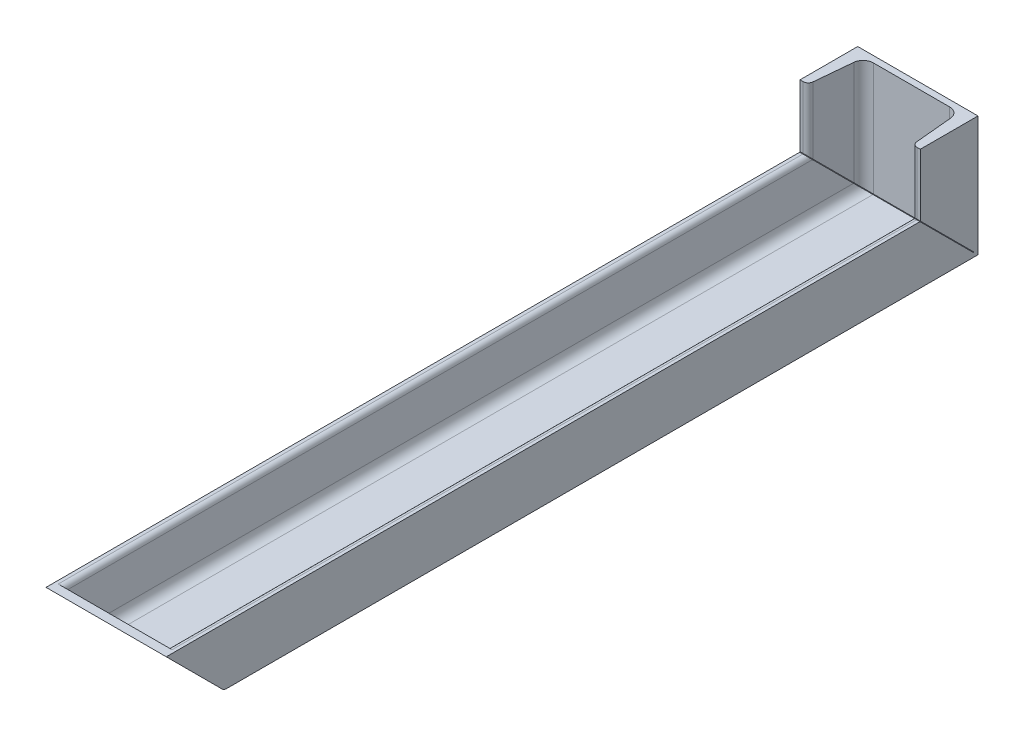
from build123d import *

# Parameters (mm, degrees)
EXTRUDE_1_DEPTH     = 667.5
EXTRUDE_2_DEPTH     = 100
CUT_EXTRUDE_1_DEPTH = 100
EXTRUDE_3_DEPTH     = 100
FILLET_1_R          = 5


with BuildPart() as part:
    # Sketch 1 → Extrude 1 (new body)
    with BuildSketch(Plane.XY):
        with BuildLine():
            Line((-50, 0), (50, 0))
            Line((50, 0), (50, 48))
            Line((50, 48), (47.324945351, 48))
            ThreePointArc((47.324945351, 48), (44.496982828, 46.905258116), (43.143253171, 44.191727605))
            Line((43.143253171, 44.191727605), (40.221987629, 13.007217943))
            ThreePointArc((40.221987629, 13.007217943), (37.482296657, 7.51554905), (31.759039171, 5.3))
            Line((31.759039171, 5.3), (-31.759039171, 5.3))
            ThreePointArc((-31.759039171, 5.3), (-37.482296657, 7.51554905), (-40.221987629, 13.007217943))
            Line((-40.221987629, 13.007217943), (-43.143253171, 44.191727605))
            ThreePointArc((-43.143253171, 44.191727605), (-44.496982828, 46.905258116), (-47.324945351, 48))
            Line((-47.324945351, 48), (-50, 48))
            Line((-50, 48), (-50, 0))
        make_face()
    extrude(amount=EXTRUDE_1_DEPTH)

    # Sketch 3 → Extrude 2 (add)
    with BuildSketch(Plane.XZ):
        with BuildLine():
            Line((-50, 0), (50, 0))
            Line((50, 0), (50, 48))
            Line((50, 48), (47.324945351, 48))
            ThreePointArc((47.324945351, 48), (44.496982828, 46.905258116), (43.143253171, 44.191727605))
            Line((43.143253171, 44.191727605), (40.221987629, 13.007217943))
            ThreePointArc((40.221987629, 13.007217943), (37.482296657, 7.51554905), (31.759039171, 5.3))
            Line((31.759039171, 5.3), (-31.759039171, 5.3))
            ThreePointArc((-31.759039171, 5.3), (-37.482296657, 7.51554905), (-40.221987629, 13.007217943))
            Line((-40.221987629, 13.007217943), (-43.143253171, 44.191727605))
            ThreePointArc((-43.143253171, 44.191727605), (-44.496982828, 46.905258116), (-47.324945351, 48))
            Line((-47.324945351, 48), (-50, 48))
            Line((-50, 48), (-50, 0))
        make_face()
    extrude(amount=-EXTRUDE_2_DEPTH)

    # Sketch 4 → Cut-Extrude 1 (cut)
    with BuildSketch(Plane.ZY.offset(50)):
        Polygon((50.111291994, 50.394134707), (3.606244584, 3.889087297), (3.889087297, 3.606244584), (50.394134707, 50.111291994), align=None)
        Polygon((667.5, 48), (667.5, 0), (619.5, 0), align=None)
    extrude(amount=-CUT_EXTRUDE_1_DEPTH, mode=Mode.SUBTRACT)

    # Sketch 5 → Extrude 3 (add)
    with BuildSketch(Plane.ZY.offset(50)):
        Polygon((619.5, 0), (667.5, 48), (674.995331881, 48), (626.995331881, 0), align=None)
    extrude(amount=-EXTRUDE_3_DEPTH)

    # Fillet 1
    fillet_1_edges = [part.edges().sort_by_distance(p)[0] for p in [
        (0, 0, 626.995331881),
    ]]
    fillet(fillet_1_edges, radius=FILLET_1_R)


solid = part.part
